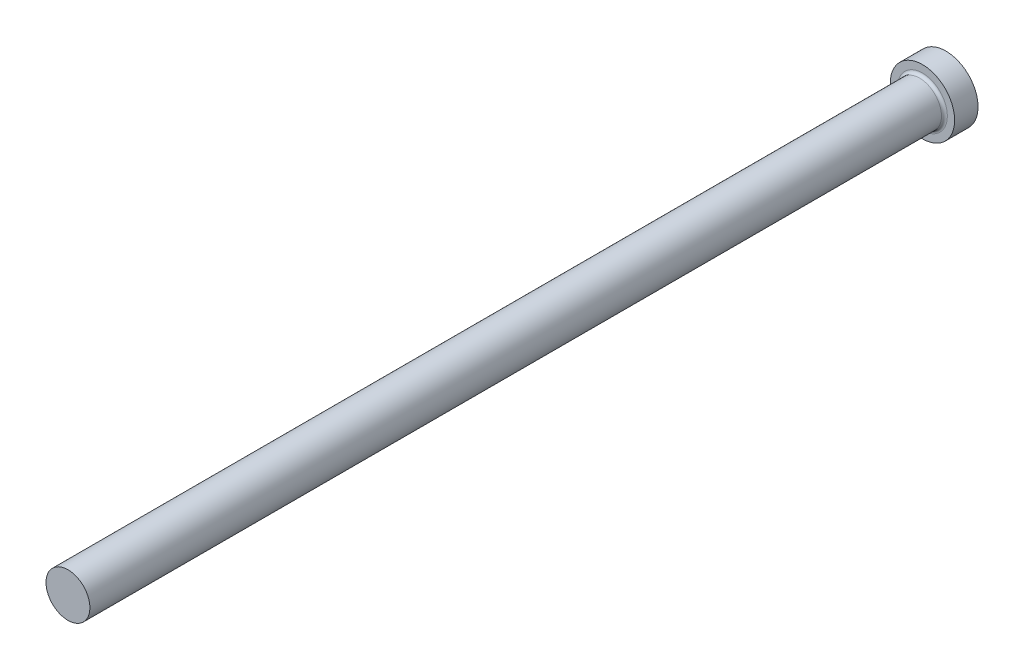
from build123d import *

# Parameters (mm, degrees)
FILLET1_R = 0.5


with BuildPart() as part:
    # FV → Revolve1 (revolve)
    with BuildSketch(Plane(origin=(0, 0, 0), x_dir=(1, 0, 0), z_dir=(0, 1, 0)), mode=Mode.PRIVATE) as revolve1_sk:
        Polygon((0, 0), (5.5, 0), (5.5, -4), (3.75, -4), (3.75, -150), (0, -150), align=None)
    revolve(revolve1_sk.sketch.rotate(Axis((0, 0, -9.033228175), (0, 0, 1)), 180), axis=Axis((0, 0, -9.033228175), (0, 0, 1)))

    # Fillet1
    fillet1_edges = [part.edges().sort_by_distance(p)[0] for p in [
        (3.75, 0, 4),
    ]]
    fillet(fillet1_edges, radius=FILLET1_R)


solid = part.part
